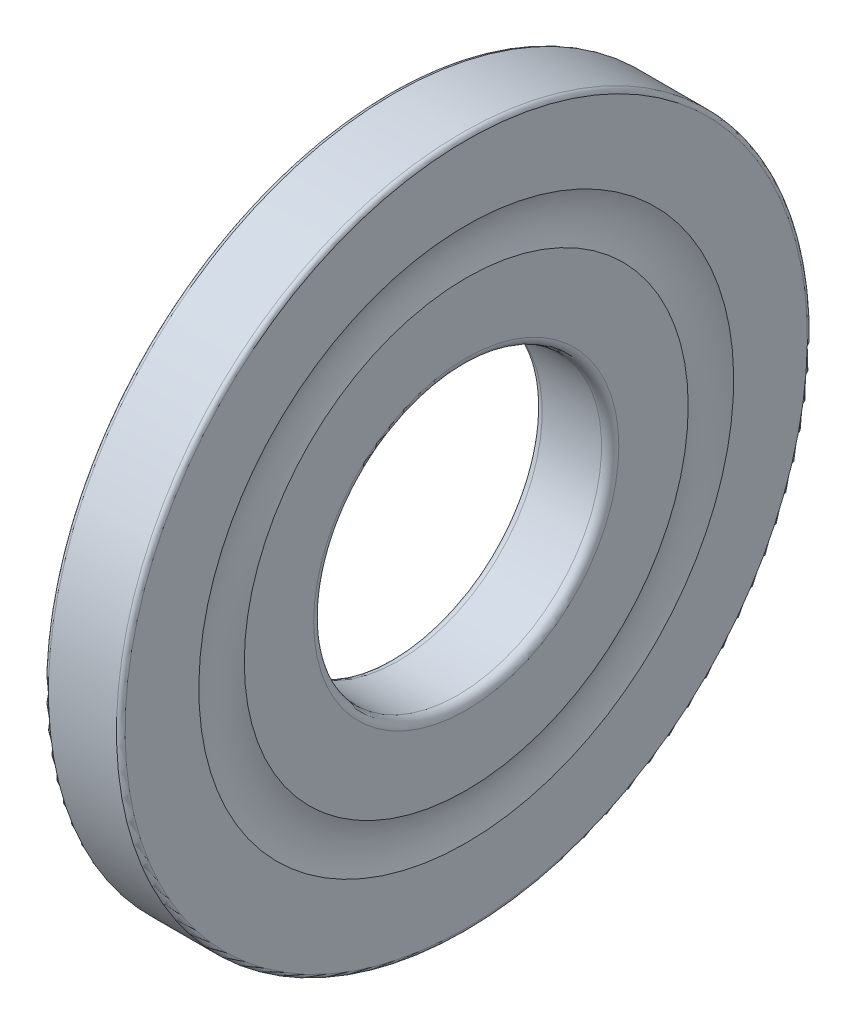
ISO-10303-21;
HEADER;
FILE_DESCRIPTION(('STEP AP214'),'2;1');
FILE_NAME('part.step','',(''),(''),'','','');
FILE_SCHEMA(('AUTOMOTIVE_DESIGN { 1 0 10303 214 1 1 1 1 }'));
ENDSEC;
DATA;
#1=APPLICATION_CONTEXT('core data for automotive mechanical design processes');
#2=APPLICATION_PROTOCOL_DEFINITION('international standard','automotive_design',2000,#1);
#3=PRODUCT_CONTEXT('',#1,'mechanical');
#4=PRODUCT('Part','Part','',(#3));
#5=PRODUCT_RELATED_PRODUCT_CATEGORY('part','',(#4));
#6=PRODUCT_DEFINITION_FORMATION('','',#4);
#7=PRODUCT_DEFINITION_CONTEXT('part definition',#1,'design');
#8=PRODUCT_DEFINITION('design','',#6,#7);
#9=PRODUCT_DEFINITION_SHAPE('','',#8);
#10=(LENGTH_UNIT() NAMED_UNIT(*) SI_UNIT(.MILLI.,.METRE.));
#11=(NAMED_UNIT(*) PLANE_ANGLE_UNIT() SI_UNIT($,.RADIAN.));
#12=(NAMED_UNIT(*) SI_UNIT($,.STERADIAN.) SOLID_ANGLE_UNIT());
#13=UNCERTAINTY_MEASURE_WITH_UNIT(LENGTH_MEASURE(1.E-05),#10,'distance_accuracy_value','');
#14=(GEOMETRIC_REPRESENTATION_CONTEXT(3) GLOBAL_UNCERTAINTY_ASSIGNED_CONTEXT((#13)) GLOBAL_UNIT_ASSIGNED_CONTEXT((#10,
#11,#12)) REPRESENTATION_CONTEXT('',''));
#15=CARTESIAN_POINT('',(0.,0.,0.));
#16=DIRECTION('',(0.,0.,1.));
#17=DIRECTION('',(1.,0.,0.));
#18=AXIS2_PLACEMENT_3D('',#15,#16,#17);
#19=CARTESIAN_POINT('',(-4.19999999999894,2.35922392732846E-13,2.4980018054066E-13));
#20=DIRECTION('',(-1.00000000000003,0.,0.));
#21=DIRECTION('',(0.,-0.999999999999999,0.));
#22=AXIS2_PLACEMENT_3D('',#19,#20,#21);
#23=TOROIDAL_SURFACE('',#22,5.3,0.299999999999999);
#24=CARTESIAN_POINT('',(-4.19999999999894,2.35922392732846E-13,2.4980018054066E-13));
#25=DIRECTION('',(-1.00000000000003,0.,0.));
#26=DIRECTION('',(0.,-0.999999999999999,0.));
#27=AXIS2_PLACEMENT_3D('',#24,#25,#26);
#28=CIRCLE('',#27,5.);
#29=CARTESIAN_POINT('',(-4.19999999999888,-4.99999999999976,2.21489493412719E-13));
#30=VERTEX_POINT('',#29);
#31=EDGE_CURVE('E10',#30,#30,#28,.T.);
#32=ORIENTED_EDGE('',*,*,#31,.F.);
#33=EDGE_LOOP('',(#32));
#34=FACE_BOUND('',#33,.T.);
#35=CARTESIAN_POINT('',(-4.50000000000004,0.,0.));
#36=DIRECTION('',(-1.00000000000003,0.,0.));
#37=DIRECTION('',(0.,-0.999999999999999,0.));
#38=AXIS2_PLACEMENT_3D('',#35,#36,#37);
#39=CIRCLE('',#38,5.3);
#40=CARTESIAN_POINT('',(-4.49999999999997,-5.30000000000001,0.));
#41=VERTEX_POINT('',#40);
#42=EDGE_CURVE('E58',#41,#41,#39,.T.);
#43=ORIENTED_EDGE('',*,*,#42,.T.);
#44=EDGE_LOOP('',(#43));
#45=FACE_BOUND('',#44,.T.);
#46=ADVANCED_FACE('F24',(#34,#45),#23,.T.);
#47=CARTESIAN_POINT('',(-4.50000000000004,0.,0.));
#48=DIRECTION('',(-1.00000000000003,0.,0.));
#49=DIRECTION('',(0.,-0.999999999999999,0.));
#50=AXIS2_PLACEMENT_3D('',#47,#48,#49);
#51=CYLINDRICAL_SURFACE('',#50,5.);
#52=CARTESIAN_POINT('',(-2.13749999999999,0.,0.));
#53=DIRECTION('',(-1.00000000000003,0.,0.));
#54=DIRECTION('',(0.,-0.999999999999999,0.));
#55=AXIS2_PLACEMENT_3D('',#52,#53,#54);
#56=CIRCLE('',#55,5.);
#57=CARTESIAN_POINT('',(-2.13749999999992,-4.99999999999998,0.));
#58=VERTEX_POINT('',#57);
#59=EDGE_CURVE('E30',#58,#58,#56,.T.);
#60=ORIENTED_EDGE('',*,*,#59,.F.);
#61=EDGE_LOOP('',(#60));
#62=FACE_BOUND('',#61,.T.);
#63=ORIENTED_EDGE('',*,*,#31,.T.);
#64=EDGE_LOOP('',(#63));
#65=FACE_BOUND('',#64,.T.);
#66=ADVANCED_FACE('F107',(#62,#65),#51,.F.);
#67=CARTESIAN_POINT('',(-2.13749999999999,0.,0.));
#68=DIRECTION('',(-1.00000000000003,0.,0.));
#69=DIRECTION('',(0.,-0.999999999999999,0.));
#70=AXIS2_PLACEMENT_3D('',#67,#68,#69);
#71=TOROIDAL_SURFACE('',#70,5.3,0.3);
#72=CARTESIAN_POINT('',(-1.83750000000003,0.,0.));
#73=DIRECTION('',(-1.00000000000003,0.,0.));
#74=DIRECTION('',(0.,-0.999999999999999,0.));
#75=AXIS2_PLACEMENT_3D('',#72,#73,#74);
#76=CIRCLE('',#75,5.3);
#77=CARTESIAN_POINT('',(-1.83749999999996,-5.29999999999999,0.));
#78=VERTEX_POINT('',#77);
#79=EDGE_CURVE('E34',#78,#78,#76,.T.);
#80=ORIENTED_EDGE('',*,*,#79,.F.);
#81=EDGE_LOOP('',(#80));
#82=FACE_BOUND('',#81,.T.);
#83=ORIENTED_EDGE('',*,*,#59,.T.);
#84=EDGE_LOOP('',(#83));
#85=FACE_BOUND('',#84,.T.);
#86=ADVANCED_FACE('F102',(#82,#85),#71,.T.);
#87=CARTESIAN_POINT('',(-1.83750000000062,5.30000000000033,8.04911692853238E-13));
#88=DIRECTION('',(-1.00000000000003,0.,0.));
#89=DIRECTION('',(0.,-0.999999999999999,0.));
#90=AXIS2_PLACEMENT_3D('',#87,#88,#89);
#91=PLANE('',#90);
#92=CARTESIAN_POINT('',(-1.83750000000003,0.,0.));
#93=DIRECTION('',(-1.00000000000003,0.,0.));
#94=DIRECTION('',(0.,-0.999999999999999,0.));
#95=AXIS2_PLACEMENT_3D('',#92,#93,#94);
#96=CIRCLE('',#95,7.71032047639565);
#97=CARTESIAN_POINT('',(-1.83749999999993,-7.71032047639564,0.));
#98=VERTEX_POINT('',#97);
#99=EDGE_CURVE('E38',#98,#98,#96,.T.);
#100=ORIENTED_EDGE('',*,*,#99,.F.);
#101=EDGE_LOOP('',(#100));
#102=FACE_BOUND('',#101,.T.);
#103=ORIENTED_EDGE('',*,*,#79,.T.);
#104=EDGE_LOOP('',(#103));
#105=FACE_BOUND('',#104,.T.);
#106=ADVANCED_FACE('F96',(#102,#105),#91,.F.);
#107=CARTESIAN_POINT('',(0.,0.,0.));
#108=DIRECTION('',(-1.00000000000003,0.,0.));
#109=DIRECTION('',(0.,-0.999999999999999,0.));
#110=AXIS2_PLACEMENT_3D('',#107,#108,#109);
#111=TOROIDAL_SURFACE('',#110,8.5,2.);
#112=CARTESIAN_POINT('',(-1.83750000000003,0.,0.));
#113=DIRECTION('',(-1.00000000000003,0.,0.));
#114=DIRECTION('',(0.,-0.999999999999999,0.));
#115=AXIS2_PLACEMENT_3D('',#112,#113,#114);
#116=CIRCLE('',#115,9.28967952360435);
#117=CARTESIAN_POINT('',(-1.83749999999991,-9.28967952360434,0.));
#118=VERTEX_POINT('',#117);
#119=EDGE_CURVE('E43',#118,#118,#116,.T.);
#120=ORIENTED_EDGE('',*,*,#119,.F.);
#121=EDGE_LOOP('',(#120));
#122=FACE_BOUND('',#121,.T.);
#123=ORIENTED_EDGE('',*,*,#99,.T.);
#124=EDGE_LOOP('',(#123));
#125=FACE_BOUND('',#124,.T.);
#126=ADVANCED_FACE('F90',(#122,#125),#111,.F.);
#127=CARTESIAN_POINT('',(-1.83749999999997,9.28967952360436,0.));
#128=DIRECTION('',(-1.00000000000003,0.,0.));
#129=DIRECTION('',(0.,-0.999999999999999,0.));
#130=AXIS2_PLACEMENT_3D('',#127,#128,#129);
#131=PLANE('',#130);
#132=CARTESIAN_POINT('',(-1.83750000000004,0.,0.));
#133=DIRECTION('',(-1.00000000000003,0.,0.));
#134=DIRECTION('',(0.,-0.999999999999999,0.));
#135=AXIS2_PLACEMENT_3D('',#132,#133,#134);
#136=CIRCLE('',#135,11.85);
#137=CARTESIAN_POINT('',(-1.83749999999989,-11.85,0.));
#138=VERTEX_POINT('',#137);
#139=EDGE_CURVE('E46',#138,#138,#136,.T.);
#140=ORIENTED_EDGE('',*,*,#139,.F.);
#141=EDGE_LOOP('',(#140));
#142=FACE_BOUND('',#141,.T.);
#143=ORIENTED_EDGE('',*,*,#119,.T.);
#144=EDGE_LOOP('',(#143));
#145=FACE_BOUND('',#144,.T.);
#146=ADVANCED_FACE('F84',(#142,#145),#131,.F.);
#147=CARTESIAN_POINT('',(-1.9875,5.68989300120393E-13,3.88578058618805E-13));
#148=DIRECTION('',(-1.00000000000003,0.,0.));
#149=DIRECTION('',(0.,-0.999999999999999,0.));
#150=AXIS2_PLACEMENT_3D('',#147,#148,#149);
#151=TOROIDAL_SURFACE('',#150,11.85,0.15);
#152=CARTESIAN_POINT('',(-1.9875,5.68989300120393E-13,3.88578058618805E-13));
#153=DIRECTION('',(-1.00000000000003,0.,0.));
#154=DIRECTION('',(0.,-0.999999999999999,0.));
#155=AXIS2_PLACEMENT_3D('',#152,#153,#154);
#156=CIRCLE('',#155,12.);
#157=CARTESIAN_POINT('',(-1.98749999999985,-11.9999999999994,3.20632409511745E-13));
#158=VERTEX_POINT('',#157);
#159=EDGE_CURVE('E49',#158,#158,#156,.T.);
#160=ORIENTED_EDGE('',*,*,#159,.F.);
#161=EDGE_LOOP('',(#160));
#162=FACE_BOUND('',#161,.T.);
#163=ORIENTED_EDGE('',*,*,#139,.T.);
#164=EDGE_LOOP('',(#163));
#165=FACE_BOUND('',#164,.T.);
#166=ADVANCED_FACE('F78',(#162,#165),#151,.T.);
#167=CARTESIAN_POINT('',(-4.50000000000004,0.,0.));
#168=DIRECTION('',(-1.00000000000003,0.,0.));
#169=DIRECTION('',(0.,-0.999999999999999,0.));
#170=AXIS2_PLACEMENT_3D('',#167,#168,#169);
#171=CYLINDRICAL_SURFACE('',#170,12.);
#172=CARTESIAN_POINT('',(-4.34999999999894,4.85722573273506E-13,4.44089209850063E-13));
#173=DIRECTION('',(-1.00000000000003,0.,0.));
#174=DIRECTION('',(0.,-0.999999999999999,0.));
#175=AXIS2_PLACEMENT_3D('',#172,#173,#174);
#176=CIRCLE('',#175,12.);
#177=CARTESIAN_POINT('',(-4.34999999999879,-11.9999999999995,3.76143560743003E-13));
#178=VERTEX_POINT('',#177);
#179=EDGE_CURVE('E52',#178,#178,#176,.T.);
#180=ORIENTED_EDGE('',*,*,#179,.F.);
#181=EDGE_LOOP('',(#180));
#182=FACE_BOUND('',#181,.T.);
#183=ORIENTED_EDGE('',*,*,#159,.T.);
#184=EDGE_LOOP('',(#183));
#185=FACE_BOUND('',#184,.T.);
#186=ADVANCED_FACE('F72',(#182,#185),#171,.T.);
#187=CARTESIAN_POINT('',(-4.34999999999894,4.85722573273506E-13,4.44089209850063E-13));
#188=DIRECTION('',(-1.00000000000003,0.,0.));
#189=DIRECTION('',(0.,-0.999999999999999,0.));
#190=AXIS2_PLACEMENT_3D('',#187,#188,#189);
#191=TOROIDAL_SURFACE('',#190,11.85,0.150000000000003);
#192=CARTESIAN_POINT('',(-4.50000000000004,0.,0.));
#193=DIRECTION('',(-1.00000000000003,0.,0.));
#194=DIRECTION('',(0.,-0.999999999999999,0.));
#195=AXIS2_PLACEMENT_3D('',#192,#193,#194);
#196=CIRCLE('',#195,11.85);
#197=CARTESIAN_POINT('',(-4.49999999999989,-11.85,0.));
#198=VERTEX_POINT('',#197);
#199=EDGE_CURVE('E55',#198,#198,#196,.T.);
#200=ORIENTED_EDGE('',*,*,#199,.F.);
#201=EDGE_LOOP('',(#200));
#202=FACE_BOUND('',#201,.T.);
#203=ORIENTED_EDGE('',*,*,#179,.T.);
#204=EDGE_LOOP('',(#203));
#205=FACE_BOUND('',#204,.T.);
#206=ADVANCED_FACE('F66',(#202,#205),#191,.T.);
#207=CARTESIAN_POINT('',(-4.5,5.30000000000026,2.35922392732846E-13));
#208=DIRECTION('',(1.00000000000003,0.,0.));
#209=DIRECTION('',(0.,0.999999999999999,0.));
#210=AXIS2_PLACEMENT_3D('',#207,#208,#209);
#211=PLANE('',#210);
#212=ORIENTED_EDGE('',*,*,#42,.F.);
#213=EDGE_LOOP('',(#212));
#214=FACE_BOUND('',#213,.T.);
#215=ORIENTED_EDGE('',*,*,#199,.T.);
#216=EDGE_LOOP('',(#215));
#217=FACE_BOUND('',#216,.T.);
#218=ADVANCED_FACE('F63',(#214,#217),#211,.F.);
#219=CLOSED_SHELL('',(#46,#66,#86,#106,#126,#146,#166,#186,#206,#218));
#220=MANIFOLD_SOLID_BREP('B2',#219);
#221=ADVANCED_BREP_SHAPE_REPRESENTATION('',(#18,#220),#14);
#222=SHAPE_DEFINITION_REPRESENTATION(#9,#221);
ENDSEC;
END-ISO-10303-21;
